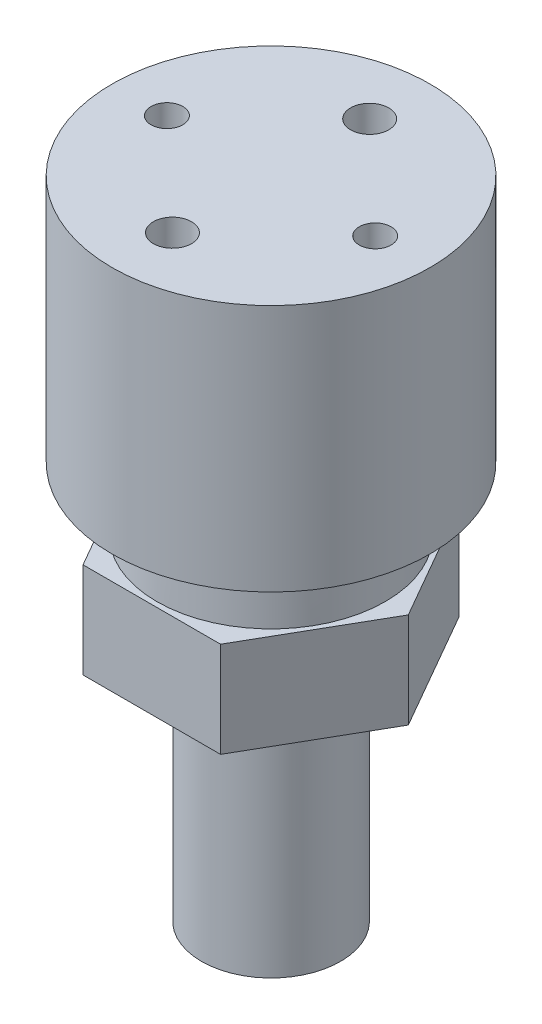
from build123d import *

# Parameters (mm, degrees)
SKETCH2_R          = 1.524
CUT_EXTRUDE1_DEPTH = 12.7
SKETCH4_R          = 1.27
CUT_EXTRUDE2_DEPTH = 12.7
EXTRUDE1_DEPTH     = 7.62
SKETCH6_R          = 5.55625
EXTRUDE2_DEPTH     = 19.05


with BuildPart() as part:
    # Sketch1 → Revolve1 (revolve)
    with BuildSketch(Plane.XY, mode=Mode.PRIVATE) as revolve1_sk:
        Polygon((0, 0), (-9.124937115, 0), (-9.015021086, 5.078810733), (-12.7, 5.078810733), (-12.7, 24.890810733), (0, 24.890810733), align=None)
    revolve(revolve1_sk.sketch.rotate(Axis((0, 55.728152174, 0), (0, -1, 0)), 270), axis=Axis((0, 55.728152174, 0), (0, -1, 0)))

    # Sketch2 → Cut-Extrude1 (cut)
    with BuildSketch(Plane(origin=(0, 24.890810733, 0), x_dir=(-1, 0, 0), z_dir=(0, 1, 0))):
        with Locations(Location((0, 7.874, 0), (0, 0, 90))):
            Circle(SKETCH2_R)
    cut_extrude1 = extrude(amount=-CUT_EXTRUDE1_DEPTH, mode=Mode.SUBTRACT)

    # Sketch4 → Cut-Extrude2 (cut)
    with BuildSketch(Plane(origin=(0, 24.890810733, 0), x_dir=(-1, 0, 0), z_dir=(0, 1, 0))):
        with Locations(Location((-8.316893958, 0, 0), (0, 0, 90))):
            Circle(SKETCH4_R)
    cut_extrude2 = extrude(amount=-CUT_EXTRUDE2_DEPTH, mode=Mode.SUBTRACT)

    # Mirror1: Cut-Extrude1 across plane
    add(cut_extrude1.mirror(Plane.XY), mode=Mode.SUBTRACT)

    # Sketch5 → Extrude1 (add)
    with BuildSketch(Plane.XZ):
        Polygon((10.960791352, 0), (5.491727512, 9.525), (-5.491727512, 9.525), (-10.960791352, 0), (-5.491727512, -9.525), (5.491727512, -9.525), align=None)
    extrude(amount=EXTRUDE1_DEPTH)

    # Sketch6 → Extrude2 (add)
    with BuildSketch(Plane.XZ.offset(7.62)):
        with Locations(Location((0, 0, 0), (0, 0, 90))):
            Circle(SKETCH6_R)
    extrude(amount=EXTRUDE2_DEPTH)

    # Mirror2: Cut-Extrude2 across plane
    add(cut_extrude2.mirror(Plane(origin=(0, 0, 0), x_dir=(0, 0, 1), z_dir=(1, 0, 0))), mode=Mode.SUBTRACT)


solid = part.part
